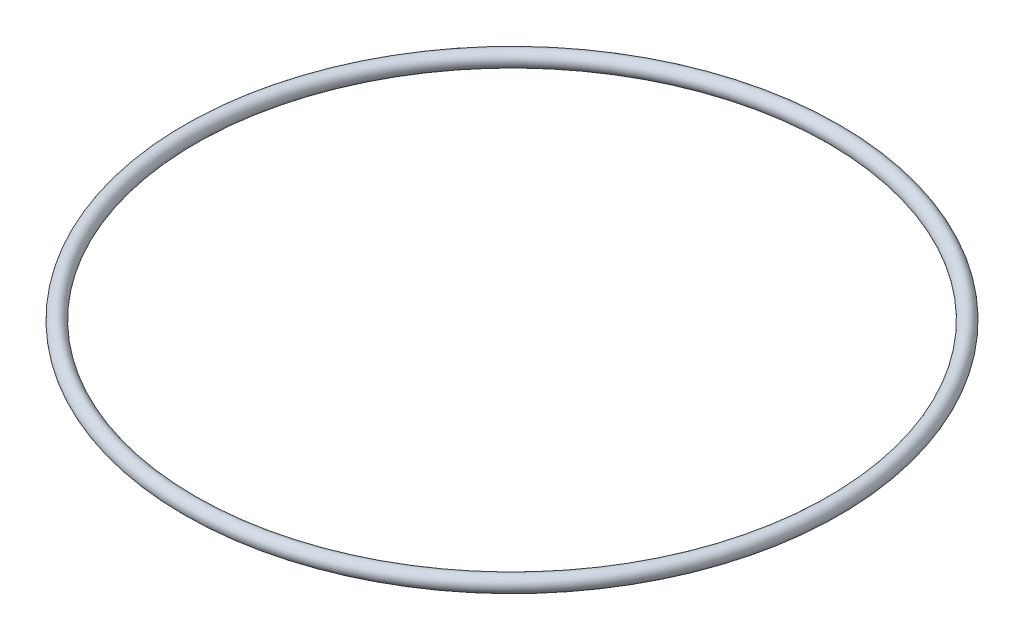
from build123d import *

# Parameters (mm, degrees)
ESQUISSE1_R = 1.5


with BuildPart() as part:
    # Esquisse1 → Base-R_volution (revolve)
    with BuildSketch(Plane.XY, mode=Mode.PRIVATE) as base_r_volution_sk:
        with Locations((63, 0)):
            Circle(ESQUISSE1_R)
    revolve(base_r_volution_sk.sketch.rotate(Axis((0, 1.5, 0), (0, -1, 0)), 90), axis=Axis((0, 1.5, 0), (0, -1, 0)))


solid = part.part
